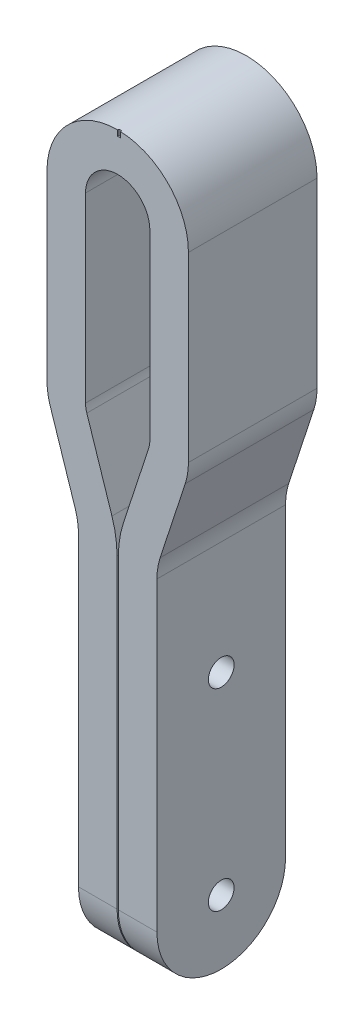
ISO-10303-21;
HEADER;
FILE_DESCRIPTION(('STEP AP214'),'2;1');
FILE_NAME('part.step','',(''),(''),'','','');
FILE_SCHEMA(('AUTOMOTIVE_DESIGN { 1 0 10303 214 1 1 1 1 }'));
ENDSEC;
DATA;
#1=APPLICATION_CONTEXT('core data for automotive mechanical design processes');
#2=APPLICATION_PROTOCOL_DEFINITION('international standard','automotive_design',2000,#1);
#3=PRODUCT_CONTEXT('',#1,'mechanical');
#4=PRODUCT('Part','Part','',(#3));
#5=PRODUCT_RELATED_PRODUCT_CATEGORY('part','',(#4));
#6=PRODUCT_DEFINITION_FORMATION('','',#4);
#7=PRODUCT_DEFINITION_CONTEXT('part definition',#1,'design');
#8=PRODUCT_DEFINITION('design','',#6,#7);
#9=PRODUCT_DEFINITION_SHAPE('','',#8);
#10=(LENGTH_UNIT() NAMED_UNIT(*) SI_UNIT(.MILLI.,.METRE.));
#11=(NAMED_UNIT(*) PLANE_ANGLE_UNIT() SI_UNIT($,.RADIAN.));
#12=(NAMED_UNIT(*) SI_UNIT($,.STERADIAN.) SOLID_ANGLE_UNIT());
#13=UNCERTAINTY_MEASURE_WITH_UNIT(LENGTH_MEASURE(1.E-05),#10,'distance_accuracy_value','');
#14=(GEOMETRIC_REPRESENTATION_CONTEXT(3) GLOBAL_UNCERTAINTY_ASSIGNED_CONTEXT((#13)) GLOBAL_UNIT_ASSIGNED_CONTEXT((#10,
#11,#12)) REPRESENTATION_CONTEXT('',''));
#15=CARTESIAN_POINT('',(0.,0.,0.));
#16=DIRECTION('',(0.,0.,1.));
#17=DIRECTION('',(1.,0.,0.));
#18=AXIS2_PLACEMENT_3D('',#15,#16,#17);
#19=CARTESIAN_POINT('',(0.0500000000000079,45.7325102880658,10.));
#20=DIRECTION('',(1.,0.,0.));
#21=DIRECTION('',(0.,1.,0.));
#22=AXIS2_PLACEMENT_3D('',#19,#20,#21);
#23=PLANE('',#22);
#24=CARTESIAN_POINT('',(0.0500000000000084,65.7325102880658,5.));
#25=DIRECTION('',(1.,0.,0.));
#26=DIRECTION('',(0.,1.,0.));
#27=AXIS2_PLACEMENT_3D('',#24,#25,#26);
#28=CIRCLE('',#27,1.);
#29=CARTESIAN_POINT('',(0.0500000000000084,66.7325102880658,5.));
#30=VERTEX_POINT('',#29);
#31=EDGE_CURVE('E271',#30,#30,#28,.T.);
#32=ORIENTED_EDGE('',*,*,#31,.T.);
#33=EDGE_LOOP('',(#32));
#34=FACE_BOUND('',#33,.T.);
#35=CARTESIAN_POINT('',(0.0500000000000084,50.7325102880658,5.));
#36=DIRECTION('',(1.,0.,0.));
#37=DIRECTION('',(0.,1.,0.));
#38=AXIS2_PLACEMENT_3D('',#35,#36,#37);
#39=CIRCLE('',#38,1.);
#40=CARTESIAN_POINT('',(0.0500000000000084,51.7325102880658,5.));
#41=VERTEX_POINT('',#40);
#42=EDGE_CURVE('E281',#41,#41,#39,.T.);
#43=ORIENTED_EDGE('',*,*,#42,.T.);
#44=EDGE_LOOP('',(#43));
#45=FACE_BOUND('',#44,.T.);
#46=CARTESIAN_POINT('',(0.050000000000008,50.7325102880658,5.));
#47=DIRECTION('',(1.,0.,0.));
#48=DIRECTION('',(0.,1.,0.));
#49=AXIS2_PLACEMENT_3D('',#46,#47,#48);
#50=CIRCLE('',#49,5.);
#51=CARTESIAN_POINT('',(0.050000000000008,50.7325102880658,0.));
#52=VERTEX_POINT('',#51);
#53=CARTESIAN_POINT('',(0.0500000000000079,45.7325102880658,5.));
#54=VERTEX_POINT('',#53);
#55=EDGE_CURVE('E450',#52,#54,#50,.F.);
#56=ORIENTED_EDGE('',*,*,#55,.T.);
#57=CARTESIAN_POINT('',(0.0500000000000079,50.7325102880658,5.));
#58=DIRECTION('',(1.,0.,0.));
#59=DIRECTION('',(0.,1.,0.));
#60=AXIS2_PLACEMENT_3D('',#57,#58,#59);
#61=CIRCLE('',#60,5.);
#62=CARTESIAN_POINT('',(0.050000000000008,50.7325102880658,10.));
#63=VERTEX_POINT('',#62);
#64=EDGE_CURVE('E452',#54,#63,#61,.F.);
#65=ORIENTED_EDGE('',*,*,#64,.T.);
#66=DIRECTION('',(0.,-1.,0.));
#67=VECTOR('',#66,1.);
#68=CARTESIAN_POINT('',(0.0500000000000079,45.7325102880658,10.));
#69=LINE('',#68,#67);
#70=CARTESIAN_POINT('',(0.0500000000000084,74.5128868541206,10.));
#71=VERTEX_POINT('',#70);
#72=EDGE_CURVE('E326',#71,#63,#69,.T.);
#73=ORIENTED_EDGE('',*,*,#72,.F.);
#74=DIRECTION('',(0.,0.,-1.));
#75=VECTOR('',#74,1.);
#76=CARTESIAN_POINT('',(0.0500000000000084,74.5128868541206,10.));
#77=LINE('',#76,#75);
#78=CARTESIAN_POINT('',(0.0500000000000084,74.5128868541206,0.));
#79=VERTEX_POINT('',#78);
#80=EDGE_CURVE('E430',#71,#79,#77,.T.);
#81=ORIENTED_EDGE('',*,*,#80,.T.);
#82=DIRECTION('',(0.,-1.,0.));
#83=VECTOR('',#82,1.);
#84=CARTESIAN_POINT('',(0.0500000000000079,45.7325102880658,0.));
#85=LINE('',#84,#83);
#86=EDGE_CURVE('E290',#79,#52,#85,.T.);
#87=ORIENTED_EDGE('',*,*,#86,.T.);
#88=EDGE_LOOP('',(#56,#65,#73,#81,#87));
#89=FACE_BOUND('',#88,.T.);
#90=ADVANCED_FACE('F31',(#34,#45,#89),#23,.F.);
#91=CARTESIAN_POINT('',(3.05000000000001,45.7325102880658,10.));
#92=DIRECTION('',(1.,0.,0.));
#93=DIRECTION('',(0.,1.,0.));
#94=AXIS2_PLACEMENT_3D('',#91,#92,#93);
#95=PLANE('',#94);
#96=CARTESIAN_POINT('',(3.05000000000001,65.7325102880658,5.));
#97=DIRECTION('',(1.,0.,0.));
#98=DIRECTION('',(0.,1.,0.));
#99=AXIS2_PLACEMENT_3D('',#96,#97,#98);
#100=CIRCLE('',#99,1.);
#101=CARTESIAN_POINT('',(3.05000000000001,66.7325102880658,5.));
#102=VERTEX_POINT('',#101);
#103=EDGE_CURVE('E264',#102,#102,#100,.T.);
#104=ORIENTED_EDGE('',*,*,#103,.F.);
#105=EDGE_LOOP('',(#104));
#106=FACE_BOUND('',#105,.T.);
#107=CARTESIAN_POINT('',(3.05000000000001,50.7325102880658,5.));
#108=DIRECTION('',(1.,0.,0.));
#109=DIRECTION('',(0.,1.,0.));
#110=AXIS2_PLACEMENT_3D('',#107,#108,#109);
#111=CIRCLE('',#110,1.);
#112=CARTESIAN_POINT('',(3.05000000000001,51.7325102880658,5.));
#113=VERTEX_POINT('',#112);
#114=EDGE_CURVE('E274',#113,#113,#111,.T.);
#115=ORIENTED_EDGE('',*,*,#114,.F.);
#116=EDGE_LOOP('',(#115));
#117=FACE_BOUND('',#116,.T.);
#118=DIRECTION('',(0.,-1.,0.));
#119=VECTOR('',#118,1.);
#120=CARTESIAN_POINT('',(3.05000000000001,45.7325102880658,10.));
#121=LINE('',#120,#119);
#122=CARTESIAN_POINT('',(3.05000000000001,74.5128868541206,10.));
#123=VERTEX_POINT('',#122);
#124=CARTESIAN_POINT('',(3.05000000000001,50.7325102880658,10.));
#125=VERTEX_POINT('',#124);
#126=EDGE_CURVE('E329',#123,#125,#121,.T.);
#127=ORIENTED_EDGE('',*,*,#126,.T.);
#128=CARTESIAN_POINT('',(3.05000000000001,50.7325102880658,5.));
#129=DIRECTION('',(1.,0.,0.));
#130=DIRECTION('',(0.,1.,0.));
#131=AXIS2_PLACEMENT_3D('',#128,#129,#130);
#132=CIRCLE('',#131,5.);
#133=CARTESIAN_POINT('',(3.05000000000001,45.7325102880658,5.));
#134=VERTEX_POINT('',#133);
#135=EDGE_CURVE('E462',#125,#134,#132,.T.);
#136=ORIENTED_EDGE('',*,*,#135,.T.);
#137=CARTESIAN_POINT('',(3.05000000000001,50.7325102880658,5.));
#138=DIRECTION('',(1.,0.,0.));
#139=DIRECTION('',(0.,1.,0.));
#140=AXIS2_PLACEMENT_3D('',#137,#138,#139);
#141=CIRCLE('',#140,5.);
#142=CARTESIAN_POINT('',(3.05000000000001,50.7325102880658,0.));
#143=VERTEX_POINT('',#142);
#144=EDGE_CURVE('E460',#134,#143,#141,.T.);
#145=ORIENTED_EDGE('',*,*,#144,.T.);
#146=DIRECTION('',(0.,-1.,0.));
#147=VECTOR('',#146,1.);
#148=CARTESIAN_POINT('',(3.05000000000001,45.7325102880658,0.));
#149=LINE('',#148,#147);
#150=CARTESIAN_POINT('',(3.05000000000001,74.5128868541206,0.));
#151=VERTEX_POINT('',#150);
#152=EDGE_CURVE('E293',#151,#143,#149,.T.);
#153=ORIENTED_EDGE('',*,*,#152,.F.);
#154=DIRECTION('',(0.,0.,-1.));
#155=VECTOR('',#154,1.);
#156=CARTESIAN_POINT('',(3.05000000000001,74.5128868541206,10.));
#157=LINE('',#156,#155);
#158=EDGE_CURVE('E396',#151,#123,#157,.F.);
#159=ORIENTED_EDGE('',*,*,#158,.T.);
#160=EDGE_LOOP('',(#127,#136,#145,#153,#159));
#161=FACE_BOUND('',#160,.T.);
#162=ADVANCED_FACE('F498',(#106,#117,#161),#95,.T.);
#163=CARTESIAN_POINT('',(3.05000000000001,75.3115226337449,10.));
#164=DIRECTION('',(0.950243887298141,-0.311506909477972,0.));
#165=DIRECTION('',(0.311506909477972,0.950243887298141,0.));
#166=AXIS2_PLACEMENT_3D('',#163,#164,#165);
#167=PLANE('',#166);
#168=DIRECTION('',(-0.311506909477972,-0.950243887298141,0.));
#169=VECTOR('',#168,1.);
#170=CARTESIAN_POINT('',(3.05000000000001,75.3115226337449,10.));
#171=LINE('',#170,#169);
#172=CARTESIAN_POINT('',(5.2512194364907,82.0262864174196,10.));
#173=VERTEX_POINT('',#172);
#174=CARTESIAN_POINT('',(3.2987805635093,76.0704214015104,10.));
#175=VERTEX_POINT('',#174);
#176=EDGE_CURVE('E332',#173,#175,#171,.T.);
#177=ORIENTED_EDGE('',*,*,#176,.T.);
#178=DIRECTION('',(0.,0.,-1.));
#179=VECTOR('',#178,1.);
#180=CARTESIAN_POINT('',(3.2987805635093,76.0704214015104,0.));
#181=LINE('',#180,#179);
#182=CARTESIAN_POINT('',(3.2987805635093,76.0704214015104,0.));
#183=VERTEX_POINT('',#182);
#184=EDGE_CURVE('E393',#175,#183,#181,.T.);
#185=ORIENTED_EDGE('',*,*,#184,.T.);
#186=DIRECTION('',(-0.311506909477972,-0.950243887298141,0.));
#187=VECTOR('',#186,1.);
#188=CARTESIAN_POINT('',(3.05000000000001,75.3115226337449,0.));
#189=LINE('',#188,#187);
#190=CARTESIAN_POINT('',(5.2512194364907,82.0262864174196,0.));
#191=VERTEX_POINT('',#190);
#192=EDGE_CURVE('E296',#191,#183,#189,.T.);
#193=ORIENTED_EDGE('',*,*,#192,.F.);
#194=DIRECTION('',(0.,0.,-1.));
#195=VECTOR('',#194,1.);
#196=CARTESIAN_POINT('',(5.2512194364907,82.0262864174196,10.));
#197=LINE('',#196,#195);
#198=EDGE_CURVE('E391',#191,#173,#197,.F.);
#199=ORIENTED_EDGE('',*,*,#198,.T.);
#200=EDGE_LOOP('',(#177,#185,#193,#199));
#201=FACE_BOUND('',#200,.T.);
#202=ADVANCED_FACE('F504',(#201),#167,.T.);
#203=CARTESIAN_POINT('',(5.49999999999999,82.7851851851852,10.));
#204=DIRECTION('',(1.,0.,0.));
#205=DIRECTION('',(0.,1.,0.));
#206=AXIS2_PLACEMENT_3D('',#203,#204,#205);
#207=PLANE('',#206);
#208=DIRECTION('',(0.,-1.,0.));
#209=VECTOR('',#208,1.);
#210=CARTESIAN_POINT('',(5.49999999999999,82.7851851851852,10.));
#211=LINE('',#210,#209);
#212=CARTESIAN_POINT('',(5.50000000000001,97.7325102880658,10.));
#213=VERTEX_POINT('',#212);
#214=CARTESIAN_POINT('',(5.5,83.5838209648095,10.));
#215=VERTEX_POINT('',#214);
#216=EDGE_CURVE('E335',#213,#215,#211,.T.);
#217=ORIENTED_EDGE('',*,*,#216,.T.);
#218=DIRECTION('',(0.,0.,-1.));
#219=VECTOR('',#218,1.);
#220=CARTESIAN_POINT('',(5.5,83.5838209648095,10.));
#221=LINE('',#220,#219);
#222=CARTESIAN_POINT('',(5.5,83.5838209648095,0.));
#223=VERTEX_POINT('',#222);
#224=EDGE_CURVE('E398',#215,#223,#221,.T.);
#225=ORIENTED_EDGE('',*,*,#224,.T.);
#226=DIRECTION('',(0.,-1.,0.));
#227=VECTOR('',#226,1.);
#228=CARTESIAN_POINT('',(5.49999999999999,82.7851851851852,0.));
#229=LINE('',#228,#227);
#230=CARTESIAN_POINT('',(5.50000000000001,97.7325102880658,0.));
#231=VERTEX_POINT('',#230);
#232=EDGE_CURVE('E299',#231,#223,#229,.T.);
#233=ORIENTED_EDGE('',*,*,#232,.F.);
#234=DIRECTION('',(0.,0.,-1.));
#235=VECTOR('',#234,1.);
#236=CARTESIAN_POINT('',(5.50000000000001,97.7325102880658,10.));
#237=LINE('',#236,#235);
#238=EDGE_CURVE('E371',#213,#231,#237,.T.);
#239=ORIENTED_EDGE('',*,*,#238,.F.);
#240=EDGE_LOOP('',(#217,#225,#233,#239));
#241=FACE_BOUND('',#240,.T.);
#242=ADVANCED_FACE('F540',(#241),#207,.T.);
#243=CARTESIAN_POINT('',(0.,97.7325102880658,10.));
#244=DIRECTION('',(0.,0.,-1.));
#245=DIRECTION('',(-1.,0.,0.));
#246=AXIS2_PLACEMENT_3D('',#243,#244,#245);
#247=CYLINDRICAL_SURFACE('',#246,5.5);
#248=DIRECTION('',(0.,0.,1.));
#249=VECTOR('',#248,1.);
#250=CARTESIAN_POINT('',(0.,103.232510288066,9.9));
#251=LINE('',#250,#249);
#252=CARTESIAN_POINT('',(0.,103.232510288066,9.9));
#253=VERTEX_POINT('',#252);
#254=CARTESIAN_POINT('',(0.,103.232510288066,10.));
#255=VERTEX_POINT('',#254);
#256=EDGE_CURVE('E239',#253,#255,#251,.T.);
#257=ORIENTED_EDGE('',*,*,#256,.F.);
#258=CARTESIAN_POINT('',(0.,97.7325102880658,9.9));
#259=DIRECTION('',(0.,0.,1.));
#260=DIRECTION('',(1.,0.,0.));
#261=AXIS2_PLACEMENT_3D('',#258,#259,#260);
#262=CIRCLE('',#261,5.5);
#263=CARTESIAN_POINT('',(0.211811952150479,103.228430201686,9.9));
#264=VERTEX_POINT('',#263);
#265=EDGE_CURVE('E11',#253,#264,#262,.F.);
#266=ORIENTED_EDGE('',*,*,#265,.T.);
#267=DIRECTION('',(0.,0.,-1.));
#268=VECTOR('',#267,1.);
#269=CARTESIAN_POINT('',(0.211811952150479,103.228430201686,10.));
#270=LINE('',#269,#268);
#271=CARTESIAN_POINT('',(0.211811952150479,103.228430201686,10.));
#272=VERTEX_POINT('',#271);
#273=EDGE_CURVE('E260',#272,#264,#270,.T.);
#274=ORIENTED_EDGE('',*,*,#273,.F.);
#275=CARTESIAN_POINT('',(0.,97.7325102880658,10.));
#276=DIRECTION('',(0.,0.,-1.));
#277=DIRECTION('',(1.,0.,0.));
#278=AXIS2_PLACEMENT_3D('',#275,#276,#277);
#279=CIRCLE('',#278,5.5);
#280=EDGE_CURVE('E250',#272,#213,#279,.T.);
#281=ORIENTED_EDGE('',*,*,#280,.T.);
#282=ORIENTED_EDGE('',*,*,#238,.T.);
#283=CARTESIAN_POINT('',(0.,97.7325102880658,0.));
#284=DIRECTION('',(0.,0.,-1.));
#285=DIRECTION('',(1.,0.,0.));
#286=AXIS2_PLACEMENT_3D('',#283,#284,#285);
#287=CIRCLE('',#286,5.5);
#288=CARTESIAN_POINT('',(-5.5,97.7325102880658,0.));
#289=VERTEX_POINT('',#288);
#290=EDGE_CURVE('E302',#289,#231,#287,.T.);
#291=ORIENTED_EDGE('',*,*,#290,.F.);
#292=DIRECTION('',(0.,0.,-1.));
#293=VECTOR('',#292,1.);
#294=CARTESIAN_POINT('',(-5.5,97.7325102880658,10.));
#295=LINE('',#294,#293);
#296=CARTESIAN_POINT('',(-5.5,97.7325102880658,10.));
#297=VERTEX_POINT('',#296);
#298=EDGE_CURVE('E368',#297,#289,#295,.T.);
#299=ORIENTED_EDGE('',*,*,#298,.F.);
#300=EDGE_CURVE('E338',#297,#255,#279,.T.);
#301=ORIENTED_EDGE('',*,*,#300,.T.);
#302=EDGE_LOOP('',(#257,#266,#274,#281,#282,#291,#299,#301));
#303=FACE_BOUND('',#302,.T.);
#304=ADVANCED_FACE('F545',(#303),#247,.T.);
#305=CARTESIAN_POINT('',(-5.49999999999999,82.7851851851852,10.));
#306=DIRECTION('',(-1.,0.,0.));
#307=DIRECTION('',(0.,-1.,0.));
#308=AXIS2_PLACEMENT_3D('',#305,#306,#307);
#309=PLANE('',#308);
#310=DIRECTION('',(0.,1.,0.));
#311=VECTOR('',#310,1.);
#312=CARTESIAN_POINT('',(-5.49999999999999,82.7851851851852,0.));
#313=LINE('',#312,#311);
#314=CARTESIAN_POINT('',(-5.49999999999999,83.5838209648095,0.));
#315=VERTEX_POINT('',#314);
#316=EDGE_CURVE('E305',#315,#289,#313,.T.);
#317=ORIENTED_EDGE('',*,*,#316,.F.);
#318=DIRECTION('',(0.,0.,-1.));
#319=VECTOR('',#318,1.);
#320=CARTESIAN_POINT('',(-5.49999999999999,83.5838209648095,10.));
#321=LINE('',#320,#319);
#322=CARTESIAN_POINT('',(-5.49999999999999,83.5838209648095,10.));
#323=VERTEX_POINT('',#322);
#324=EDGE_CURVE('E385',#315,#323,#321,.F.);
#325=ORIENTED_EDGE('',*,*,#324,.T.);
#326=DIRECTION('',(0.,1.,0.));
#327=VECTOR('',#326,1.);
#328=CARTESIAN_POINT('',(-5.49999999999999,82.7851851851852,10.));
#329=LINE('',#328,#327);
#330=EDGE_CURVE('E341',#323,#297,#329,.T.);
#331=ORIENTED_EDGE('',*,*,#330,.T.);
#332=ORIENTED_EDGE('',*,*,#298,.T.);
#333=EDGE_LOOP('',(#317,#325,#331,#332));
#334=FACE_BOUND('',#333,.T.);
#335=ADVANCED_FACE('F668',(#334),#309,.T.);
#336=CARTESIAN_POINT('',(-3.05,75.3115226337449,10.));
#337=DIRECTION('',(-0.950243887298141,-0.311506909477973,0.));
#338=DIRECTION('',(0.311506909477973,-0.950243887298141,0.));
#339=AXIS2_PLACEMENT_3D('',#336,#337,#338);
#340=PLANE('',#339);
#341=DIRECTION('',(-0.311506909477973,0.950243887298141,0.));
#342=VECTOR('',#341,1.);
#343=CARTESIAN_POINT('',(-3.05,75.3115226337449,0.));
#344=LINE('',#343,#342);
#345=CARTESIAN_POINT('',(-3.29878056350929,76.0704214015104,0.));
#346=VERTEX_POINT('',#345);
#347=CARTESIAN_POINT('',(-5.2512194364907,82.0262864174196,0.));
#348=VERTEX_POINT('',#347);
#349=EDGE_CURVE('E307',#346,#348,#344,.T.);
#350=ORIENTED_EDGE('',*,*,#349,.F.);
#351=DIRECTION('',(0.,0.,-1.));
#352=VECTOR('',#351,1.);
#353=CARTESIAN_POINT('',(-3.29878056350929,76.0704214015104,10.));
#354=LINE('',#353,#352);
#355=CARTESIAN_POINT('',(-3.29878056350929,76.0704214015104,10.));
#356=VERTEX_POINT('',#355);
#357=EDGE_CURVE('E379',#346,#356,#354,.F.);
#358=ORIENTED_EDGE('',*,*,#357,.T.);
#359=DIRECTION('',(-0.311506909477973,0.950243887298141,0.));
#360=VECTOR('',#359,1.);
#361=CARTESIAN_POINT('',(-3.05,75.3115226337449,10.));
#362=LINE('',#361,#360);
#363=CARTESIAN_POINT('',(-5.2512194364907,82.0262864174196,10.));
#364=VERTEX_POINT('',#363);
#365=EDGE_CURVE('E343',#356,#364,#362,.T.);
#366=ORIENTED_EDGE('',*,*,#365,.T.);
#367=DIRECTION('',(0.,0.,-1.));
#368=VECTOR('',#367,1.);
#369=CARTESIAN_POINT('',(-5.2512194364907,82.0262864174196,10.));
#370=LINE('',#369,#368);
#371=EDGE_CURVE('E376',#364,#348,#370,.T.);
#372=ORIENTED_EDGE('',*,*,#371,.T.);
#373=EDGE_LOOP('',(#350,#358,#366,#372));
#374=FACE_BOUND('',#373,.T.);
#375=ADVANCED_FACE('F561',(#374),#340,.T.);
#376=CARTESIAN_POINT('',(-3.04999999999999,45.7325102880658,10.));
#377=DIRECTION('',(-1.,0.,0.));
#378=DIRECTION('',(0.,-1.,0.));
#379=AXIS2_PLACEMENT_3D('',#376,#377,#378);
#380=PLANE('',#379);
#381=CARTESIAN_POINT('',(-3.05,65.7325102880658,5.));
#382=DIRECTION('',(-1.,0.,0.));
#383=DIRECTION('',(0.,-1.,0.));
#384=AXIS2_PLACEMENT_3D('',#381,#382,#383);
#385=CIRCLE('',#384,1.);
#386=CARTESIAN_POINT('',(-3.05,64.7325102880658,5.));
#387=VERTEX_POINT('',#386);
#388=EDGE_CURVE('E268',#387,#387,#385,.T.);
#389=ORIENTED_EDGE('',*,*,#388,.F.);
#390=EDGE_LOOP('',(#389));
#391=FACE_BOUND('',#390,.T.);
#392=CARTESIAN_POINT('',(-3.04999999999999,50.7325102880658,5.));
#393=DIRECTION('',(-1.,0.,0.));
#394=DIRECTION('',(0.,-1.,0.));
#395=AXIS2_PLACEMENT_3D('',#392,#393,#394);
#396=CIRCLE('',#395,1.);
#397=CARTESIAN_POINT('',(-3.04999999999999,49.7325102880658,5.));
#398=VERTEX_POINT('',#397);
#399=EDGE_CURVE('E278',#398,#398,#396,.T.);
#400=ORIENTED_EDGE('',*,*,#399,.F.);
#401=EDGE_LOOP('',(#400));
#402=FACE_BOUND('',#401,.T.);
#403=CARTESIAN_POINT('',(-3.04999999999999,50.7325102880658,5.));
#404=DIRECTION('',(-1.,0.,0.));
#405=DIRECTION('',(0.,-1.,0.));
#406=AXIS2_PLACEMENT_3D('',#403,#404,#405);
#407=CIRCLE('',#406,5.);
#408=CARTESIAN_POINT('',(-3.04999999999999,50.7325102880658,0.));
#409=VERTEX_POINT('',#408);
#410=CARTESIAN_POINT('',(-3.04999999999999,45.7325102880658,5.));
#411=VERTEX_POINT('',#410);
#412=EDGE_CURVE('E464',#409,#411,#407,.T.);
#413=ORIENTED_EDGE('',*,*,#412,.T.);
#414=CARTESIAN_POINT('',(-3.04999999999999,50.7325102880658,5.));
#415=DIRECTION('',(-1.,0.,0.));
#416=DIRECTION('',(0.,-1.,0.));
#417=AXIS2_PLACEMENT_3D('',#414,#415,#416);
#418=CIRCLE('',#417,5.);
#419=CARTESIAN_POINT('',(-3.04999999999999,50.7325102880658,10.));
#420=VERTEX_POINT('',#419);
#421=EDGE_CURVE('E466',#411,#420,#418,.T.);
#422=ORIENTED_EDGE('',*,*,#421,.T.);
#423=DIRECTION('',(0.,1.,0.));
#424=VECTOR('',#423,1.);
#425=CARTESIAN_POINT('',(-3.04999999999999,45.7325102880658,10.));
#426=LINE('',#425,#424);
#427=CARTESIAN_POINT('',(-3.05,74.5128868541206,10.));
#428=VERTEX_POINT('',#427);
#429=EDGE_CURVE('E346',#420,#428,#426,.T.);
#430=ORIENTED_EDGE('',*,*,#429,.T.);
#431=DIRECTION('',(0.,0.,-1.));
#432=VECTOR('',#431,1.);
#433=CARTESIAN_POINT('',(-3.05,74.5128868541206,0.));
#434=LINE('',#433,#432);
#435=CARTESIAN_POINT('',(-3.05,74.5128868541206,0.));
#436=VERTEX_POINT('',#435);
#437=EDGE_CURVE('E373',#428,#436,#434,.T.);
#438=ORIENTED_EDGE('',*,*,#437,.T.);
#439=DIRECTION('',(0.,1.,0.));
#440=VECTOR('',#439,1.);
#441=CARTESIAN_POINT('',(-3.04999999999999,45.7325102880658,0.));
#442=LINE('',#441,#440);
#443=EDGE_CURVE('E310',#409,#436,#442,.T.);
#444=ORIENTED_EDGE('',*,*,#443,.F.);
#445=EDGE_LOOP('',(#413,#422,#430,#438,#444));
#446=FACE_BOUND('',#445,.T.);
#447=ADVANCED_FACE('F574',(#391,#402,#446),#380,.T.);
#448=CARTESIAN_POINT('',(-0.0499999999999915,45.7325102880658,10.));
#449=DIRECTION('',(-1.,0.,0.));
#450=DIRECTION('',(0.,-1.,0.));
#451=AXIS2_PLACEMENT_3D('',#448,#449,#450);
#452=PLANE('',#451);
#453=CARTESIAN_POINT('',(-0.0499999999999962,65.7325102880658,5.));
#454=DIRECTION('',(-1.,0.,0.));
#455=DIRECTION('',(0.,-1.,0.));
#456=AXIS2_PLACEMENT_3D('',#453,#454,#455);
#457=CIRCLE('',#456,1.);
#458=CARTESIAN_POINT('',(-0.049999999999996,64.7325102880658,5.));
#459=VERTEX_POINT('',#458);
#460=EDGE_CURVE('E267',#459,#459,#457,.T.);
#461=ORIENTED_EDGE('',*,*,#460,.T.);
#462=EDGE_LOOP('',(#461));
#463=FACE_BOUND('',#462,.T.);
#464=CARTESIAN_POINT('',(-0.0499999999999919,50.7325102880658,5.));
#465=DIRECTION('',(-1.,0.,0.));
#466=DIRECTION('',(0.,-1.,0.));
#467=AXIS2_PLACEMENT_3D('',#464,#465,#466);
#468=CIRCLE('',#467,1.);
#469=CARTESIAN_POINT('',(-0.0499999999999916,49.7325102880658,5.));
#470=VERTEX_POINT('',#469);
#471=EDGE_CURVE('E277',#470,#470,#468,.T.);
#472=ORIENTED_EDGE('',*,*,#471,.T.);
#473=EDGE_LOOP('',(#472));
#474=FACE_BOUND('',#473,.T.);
#475=DIRECTION('',(0.,1.,0.));
#476=VECTOR('',#475,1.);
#477=CARTESIAN_POINT('',(-0.0499999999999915,45.7325102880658,10.));
#478=LINE('',#477,#476);
#479=CARTESIAN_POINT('',(-0.0499999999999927,50.7325102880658,10.));
#480=VERTEX_POINT('',#479);
#481=CARTESIAN_POINT('',(-0.0499999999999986,74.5128868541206,10.));
#482=VERTEX_POINT('',#481);
#483=EDGE_CURVE('E348',#480,#482,#478,.T.);
#484=ORIENTED_EDGE('',*,*,#483,.F.);
#485=CARTESIAN_POINT('',(-0.0499999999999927,50.7325102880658,5.));
#486=DIRECTION('',(-1.,0.,0.));
#487=DIRECTION('',(0.,-1.,0.));
#488=AXIS2_PLACEMENT_3D('',#485,#486,#487);
#489=CIRCLE('',#488,5.);
#490=CARTESIAN_POINT('',(-0.0499999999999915,45.7325102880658,5.));
#491=VERTEX_POINT('',#490);
#492=EDGE_CURVE('E53',#480,#491,#489,.F.);
#493=ORIENTED_EDGE('',*,*,#492,.T.);
#494=CARTESIAN_POINT('',(-0.0499999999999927,50.7325102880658,5.));
#495=DIRECTION('',(-1.,0.,0.));
#496=DIRECTION('',(0.,-1.,0.));
#497=AXIS2_PLACEMENT_3D('',#494,#495,#496);
#498=CIRCLE('',#497,5.);
#499=CARTESIAN_POINT('',(-0.0499999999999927,50.7325102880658,0.));
#500=VERTEX_POINT('',#499);
#501=EDGE_CURVE('E468',#491,#500,#498,.F.);
#502=ORIENTED_EDGE('',*,*,#501,.T.);
#503=DIRECTION('',(0.,1.,0.));
#504=VECTOR('',#503,1.);
#505=CARTESIAN_POINT('',(-0.0499999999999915,45.7325102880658,0.));
#506=LINE('',#505,#504);
#507=CARTESIAN_POINT('',(-0.0499999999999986,74.5128868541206,0.));
#508=VERTEX_POINT('',#507);
#509=EDGE_CURVE('E312',#500,#508,#506,.T.);
#510=ORIENTED_EDGE('',*,*,#509,.T.);
#511=DIRECTION('',(0.,0.,-1.));
#512=VECTOR('',#511,1.);
#513=CARTESIAN_POINT('',(-0.0499999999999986,74.5128868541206,10.));
#514=LINE('',#513,#512);
#515=EDGE_CURVE('E447',#508,#482,#514,.F.);
#516=ORIENTED_EDGE('',*,*,#515,.T.);
#517=EDGE_LOOP('',(#484,#493,#502,#510,#516));
#518=FACE_BOUND('',#517,.T.);
#519=ADVANCED_FACE('F478',(#463,#474,#518),#452,.F.);
#520=CARTESIAN_POINT('',(-0.199268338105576,76.2460433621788,10.));
#521=DIRECTION('',(-0.950243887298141,-0.311506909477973,0.));
#522=DIRECTION('',(0.311506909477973,-0.950243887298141,0.));
#523=AXIS2_PLACEMENT_3D('',#520,#521,#522);
#524=PLANE('',#523);
#525=DIRECTION('',(-0.311506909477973,0.950243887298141,0.));
#526=VECTOR('',#525,1.);
#527=CARTESIAN_POINT('',(-0.199268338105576,76.2460433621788,10.));
#528=LINE('',#527,#526);
#529=CARTESIAN_POINT('',(-0.448048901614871,77.0049421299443,10.));
#530=VERTEX_POINT('',#529);
#531=CARTESIAN_POINT('',(-2.40048777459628,82.9608071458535,10.));
#532=VERTEX_POINT('',#531);
#533=EDGE_CURVE('E350',#530,#532,#528,.T.);
#534=ORIENTED_EDGE('',*,*,#533,.F.);
#535=DIRECTION('',(0.,0.,-1.));
#536=VECTOR('',#535,1.);
#537=CARTESIAN_POINT('',(-0.448048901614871,77.0049421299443,10.));
#538=LINE('',#537,#536);
#539=CARTESIAN_POINT('',(-0.448048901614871,77.0049421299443,0.));
#540=VERTEX_POINT('',#539);
#541=EDGE_CURVE('E444',#530,#540,#538,.T.);
#542=ORIENTED_EDGE('',*,*,#541,.T.);
#543=DIRECTION('',(-0.311506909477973,0.950243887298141,0.));
#544=VECTOR('',#543,1.);
#545=CARTESIAN_POINT('',(-0.199268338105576,76.2460433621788,0.));
#546=LINE('',#545,#544);
#547=CARTESIAN_POINT('',(-2.40048777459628,82.9608071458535,0.));
#548=VERTEX_POINT('',#547);
#549=EDGE_CURVE('E314',#540,#548,#546,.T.);
#550=ORIENTED_EDGE('',*,*,#549,.T.);
#551=DIRECTION('',(0.,0.,-1.));
#552=VECTOR('',#551,1.);
#553=CARTESIAN_POINT('',(-2.40048777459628,82.9608071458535,10.));
#554=LINE('',#553,#552);
#555=EDGE_CURVE('E413',#548,#532,#554,.F.);
#556=ORIENTED_EDGE('',*,*,#555,.T.);
#557=EDGE_LOOP('',(#534,#542,#550,#556));
#558=FACE_BOUND('',#557,.T.);
#559=ADVANCED_FACE('F593',(#558),#524,.F.);
#560=CARTESIAN_POINT('',(-2.49999999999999,82.7851851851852,10.));
#561=DIRECTION('',(-1.,0.,0.));
#562=DIRECTION('',(0.,-1.,0.));
#563=AXIS2_PLACEMENT_3D('',#560,#561,#562);
#564=PLANE('',#563);
#565=DIRECTION('',(0.,1.,0.));
#566=VECTOR('',#565,1.);
#567=CARTESIAN_POINT('',(-2.49999999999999,82.7851851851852,10.));
#568=LINE('',#567,#566);
#569=CARTESIAN_POINT('',(-2.49999999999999,83.5838209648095,10.));
#570=VERTEX_POINT('',#569);
#571=CARTESIAN_POINT('',(-2.5,97.7325102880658,10.));
#572=VERTEX_POINT('',#571);
#573=EDGE_CURVE('E352',#570,#572,#568,.T.);
#574=ORIENTED_EDGE('',*,*,#573,.F.);
#575=DIRECTION('',(0.,0.,-1.));
#576=VECTOR('',#575,1.);
#577=CARTESIAN_POINT('',(-2.49999999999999,83.5838209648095,0.));
#578=LINE('',#577,#576);
#579=CARTESIAN_POINT('',(-2.49999999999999,83.5838209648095,0.));
#580=VERTEX_POINT('',#579);
#581=EDGE_CURVE('E410',#570,#580,#578,.T.);
#582=ORIENTED_EDGE('',*,*,#581,.T.);
#583=DIRECTION('',(0.,1.,0.));
#584=VECTOR('',#583,1.);
#585=CARTESIAN_POINT('',(-2.49999999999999,82.7851851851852,0.));
#586=LINE('',#585,#584);
#587=CARTESIAN_POINT('',(-2.5,97.7325102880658,0.));
#588=VERTEX_POINT('',#587);
#589=EDGE_CURVE('E316',#580,#588,#586,.T.);
#590=ORIENTED_EDGE('',*,*,#589,.T.);
#591=DIRECTION('',(0.,0.,-1.));
#592=VECTOR('',#591,1.);
#593=CARTESIAN_POINT('',(-2.5,97.7325102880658,10.));
#594=LINE('',#593,#592);
#595=EDGE_CURVE('E365',#572,#588,#594,.T.);
#596=ORIENTED_EDGE('',*,*,#595,.F.);
#597=EDGE_LOOP('',(#574,#582,#590,#596));
#598=FACE_BOUND('',#597,.T.);
#599=ADVANCED_FACE('F602',(#598),#564,.F.);
#600=CARTESIAN_POINT('',(0.,97.7325102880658,10.));
#601=DIRECTION('',(0.,0.,-1.));
#602=DIRECTION('',(-1.,0.,0.));
#603=AXIS2_PLACEMENT_3D('',#600,#601,#602);
#604=CYLINDRICAL_SURFACE('',#603,2.5);
#605=CARTESIAN_POINT('',(0.,97.7325102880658,0.));
#606=DIRECTION('',(0.,0.,1.));
#607=DIRECTION('',(1.,0.,0.));
#608=AXIS2_PLACEMENT_3D('',#605,#606,#607);
#609=CIRCLE('',#608,2.5);
#610=CARTESIAN_POINT('',(2.5,97.7325102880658,0.));
#611=VERTEX_POINT('',#610);
#612=EDGE_CURVE('E318',#588,#611,#609,.F.);
#613=ORIENTED_EDGE('',*,*,#612,.T.);
#614=DIRECTION('',(0.,0.,-1.));
#615=VECTOR('',#614,1.);
#616=CARTESIAN_POINT('',(2.5,97.7325102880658,10.));
#617=LINE('',#616,#615);
#618=CARTESIAN_POINT('',(2.5,97.7325102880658,10.));
#619=VERTEX_POINT('',#618);
#620=EDGE_CURVE('E362',#619,#611,#617,.T.);
#621=ORIENTED_EDGE('',*,*,#620,.F.);
#622=CARTESIAN_POINT('',(0.,97.7325102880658,10.));
#623=DIRECTION('',(0.,0.,1.));
#624=DIRECTION('',(1.,0.,0.));
#625=AXIS2_PLACEMENT_3D('',#622,#623,#624);
#626=CIRCLE('',#625,2.5);
#627=EDGE_CURVE('E354',#572,#619,#626,.F.);
#628=ORIENTED_EDGE('',*,*,#627,.F.);
#629=ORIENTED_EDGE('',*,*,#595,.T.);
#630=EDGE_LOOP('',(#613,#621,#628,#629));
#631=FACE_BOUND('',#630,.T.);
#632=ADVANCED_FACE('F608',(#631),#604,.F.);
#633=CARTESIAN_POINT('',(2.49999999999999,82.7851851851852,10.));
#634=DIRECTION('',(1.,0.,0.));
#635=DIRECTION('',(0.,1.,0.));
#636=AXIS2_PLACEMENT_3D('',#633,#634,#635);
#637=PLANE('',#636);
#638=DIRECTION('',(0.,-1.,0.));
#639=VECTOR('',#638,1.);
#640=CARTESIAN_POINT('',(2.49999999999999,82.7851851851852,0.));
#641=LINE('',#640,#639);
#642=CARTESIAN_POINT('',(2.49999999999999,83.5838209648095,0.));
#643=VERTEX_POINT('',#642);
#644=EDGE_CURVE('E320',#611,#643,#641,.T.);
#645=ORIENTED_EDGE('',*,*,#644,.T.);
#646=DIRECTION('',(0.,0.,-1.));
#647=VECTOR('',#646,1.);
#648=CARTESIAN_POINT('',(2.49999999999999,83.5838209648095,10.));
#649=LINE('',#648,#647);
#650=CARTESIAN_POINT('',(2.49999999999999,83.5838209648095,10.));
#651=VERTEX_POINT('',#650);
#652=EDGE_CURVE('E419',#643,#651,#649,.F.);
#653=ORIENTED_EDGE('',*,*,#652,.T.);
#654=DIRECTION('',(0.,-1.,0.));
#655=VECTOR('',#654,1.);
#656=CARTESIAN_POINT('',(2.49999999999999,82.7851851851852,10.));
#657=LINE('',#656,#655);
#658=EDGE_CURVE('E356',#619,#651,#657,.T.);
#659=ORIENTED_EDGE('',*,*,#658,.F.);
#660=ORIENTED_EDGE('',*,*,#620,.T.);
#661=EDGE_LOOP('',(#645,#653,#659,#660));
#662=FACE_BOUND('',#661,.T.);
#663=ADVANCED_FACE('F652',(#662),#637,.F.);
#664=CARTESIAN_POINT('',(0.199268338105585,76.2460433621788,10.));
#665=DIRECTION('',(0.950243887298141,-0.311506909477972,0.));
#666=DIRECTION('',(0.311506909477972,0.950243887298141,0.));
#667=AXIS2_PLACEMENT_3D('',#664,#665,#666);
#668=PLANE('',#667);
#669=DIRECTION('',(-0.311506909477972,-0.950243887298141,0.));
#670=VECTOR('',#669,1.);
#671=CARTESIAN_POINT('',(0.199268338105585,76.2460433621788,0.));
#672=LINE('',#671,#670);
#673=CARTESIAN_POINT('',(2.40048777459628,82.9608071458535,0.));
#674=VERTEX_POINT('',#673);
#675=CARTESIAN_POINT('',(0.448048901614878,77.0049421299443,0.));
#676=VERTEX_POINT('',#675);
#677=EDGE_CURVE('E323',#674,#676,#672,.T.);
#678=ORIENTED_EDGE('',*,*,#677,.T.);
#679=DIRECTION('',(0.,0.,-1.));
#680=VECTOR('',#679,1.);
#681=CARTESIAN_POINT('',(0.448048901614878,77.0049421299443,10.));
#682=LINE('',#681,#680);
#683=CARTESIAN_POINT('',(0.448048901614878,77.0049421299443,10.));
#684=VERTEX_POINT('',#683);
#685=EDGE_CURVE('E438',#676,#684,#682,.F.);
#686=ORIENTED_EDGE('',*,*,#685,.T.);
#687=DIRECTION('',(-0.311506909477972,-0.950243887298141,0.));
#688=VECTOR('',#687,1.);
#689=CARTESIAN_POINT('',(0.199268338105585,76.2460433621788,10.));
#690=LINE('',#689,#688);
#691=CARTESIAN_POINT('',(2.40048777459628,82.9608071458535,10.));
#692=VERTEX_POINT('',#691);
#693=EDGE_CURVE('E359',#692,#684,#690,.T.);
#694=ORIENTED_EDGE('',*,*,#693,.F.);
#695=DIRECTION('',(0.,0.,-1.));
#696=VECTOR('',#695,1.);
#697=CARTESIAN_POINT('',(2.40048777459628,82.9608071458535,0.));
#698=LINE('',#697,#696);
#699=EDGE_CURVE('E416',#692,#674,#698,.T.);
#700=ORIENTED_EDGE('',*,*,#699,.T.);
#701=EDGE_LOOP('',(#678,#686,#694,#700));
#702=FACE_BOUND('',#701,.T.);
#703=ADVANCED_FACE('F619',(#702),#668,.F.);
#704=CARTESIAN_POINT('',(0.,97.7325102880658,10.));
#705=DIRECTION('',(0.,0.,-1.));
#706=DIRECTION('',(-1.,0.,0.));
#707=AXIS2_PLACEMENT_3D('',#704,#705,#706);
#708=PLANE('',#707);
#709=DIRECTION('',(1.,0.,0.));
#710=VECTOR('',#709,1.);
#711=CARTESIAN_POINT('',(0.,102.799107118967,10.));
#712=LINE('',#711,#710);
#713=CARTESIAN_POINT('',(0.,102.799107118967,10.));
#714=VERTEX_POINT('',#713);
#715=CARTESIAN_POINT('',(0.211811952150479,102.799107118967,10.));
#716=VERTEX_POINT('',#715);
#717=EDGE_CURVE('E243',#714,#716,#712,.T.);
#718=ORIENTED_EDGE('',*,*,#717,.F.);
#719=DIRECTION('',(0.,-1.,0.));
#720=VECTOR('',#719,1.);
#721=CARTESIAN_POINT('',(0.,103.232510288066,10.));
#722=LINE('',#721,#720);
#723=EDGE_CURVE('E45',#255,#714,#722,.T.);
#724=ORIENTED_EDGE('',*,*,#723,.F.);
#725=ORIENTED_EDGE('',*,*,#300,.F.);
#726=ORIENTED_EDGE('',*,*,#330,.F.);
#727=CARTESIAN_POINT('',(-0.499999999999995,83.5838209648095,10.));
#728=DIRECTION('',(0.,0.,-1.));
#729=DIRECTION('',(-1.,0.,0.));
#730=AXIS2_PLACEMENT_3D('',#727,#728,#729);
#731=CIRCLE('',#730,5.);
#732=EDGE_CURVE('E389',#323,#364,#731,.F.);
#733=ORIENTED_EDGE('',*,*,#732,.T.);
#734=ORIENTED_EDGE('',*,*,#365,.F.);
#735=CARTESIAN_POINT('',(-8.05,74.5128868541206,10.));
#736=DIRECTION('',(0.,0.,-1.));
#737=DIRECTION('',(-1.,0.,0.));
#738=AXIS2_PLACEMENT_3D('',#735,#736,#737);
#739=CIRCLE('',#738,5.);
#740=EDGE_CURVE('E403',#356,#428,#739,.T.);
#741=ORIENTED_EDGE('',*,*,#740,.T.);
#742=ORIENTED_EDGE('',*,*,#429,.F.);
#743=DIRECTION('',(-1.,0.,0.));
#744=VECTOR('',#743,1.);
#745=CARTESIAN_POINT('',(-0.0499999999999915,50.7325102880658,10.));
#746=LINE('',#745,#744);
#747=EDGE_CURVE('E454',#420,#480,#746,.F.);
#748=ORIENTED_EDGE('',*,*,#747,.T.);
#749=ORIENTED_EDGE('',*,*,#483,.T.);
#750=CARTESIAN_POINT('',(-8.05,74.5128868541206,10.));
#751=DIRECTION('',(0.,0.,-1.));
#752=DIRECTION('',(-1.,0.,0.));
#753=AXIS2_PLACEMENT_3D('',#750,#751,#752);
#754=CIRCLE('',#753,8.);
#755=EDGE_CURVE('E440',#482,#530,#754,.F.);
#756=ORIENTED_EDGE('',*,*,#755,.T.);
#757=ORIENTED_EDGE('',*,*,#533,.T.);
#758=CARTESIAN_POINT('',(-0.499999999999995,83.5838209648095,10.));
#759=DIRECTION('',(0.,0.,-1.));
#760=DIRECTION('',(-1.,0.,0.));
#761=AXIS2_PLACEMENT_3D('',#758,#759,#760);
#762=CIRCLE('',#761,2.);
#763=EDGE_CURVE('E424',#532,#570,#762,.T.);
#764=ORIENTED_EDGE('',*,*,#763,.T.);
#765=ORIENTED_EDGE('',*,*,#573,.T.);
#766=ORIENTED_EDGE('',*,*,#627,.T.);
#767=ORIENTED_EDGE('',*,*,#658,.T.);
#768=CARTESIAN_POINT('',(0.499999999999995,83.5838209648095,10.));
#769=DIRECTION('',(0.,0.,-1.));
#770=DIRECTION('',(-1.,0.,0.));
#771=AXIS2_PLACEMENT_3D('',#768,#769,#770);
#772=CIRCLE('',#771,2.);
#773=EDGE_CURVE('E428',#651,#692,#772,.T.);
#774=ORIENTED_EDGE('',*,*,#773,.T.);
#775=ORIENTED_EDGE('',*,*,#693,.T.);
#776=CARTESIAN_POINT('',(8.05000000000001,74.5128868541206,10.));
#777=DIRECTION('',(0.,0.,-1.));
#778=DIRECTION('',(-1.,0.,0.));
#779=AXIS2_PLACEMENT_3D('',#776,#777,#778);
#780=CIRCLE('',#779,8.);
#781=EDGE_CURVE('E442',#684,#71,#780,.F.);
#782=ORIENTED_EDGE('',*,*,#781,.T.);
#783=ORIENTED_EDGE('',*,*,#72,.T.);
#784=DIRECTION('',(-1.,0.,0.));
#785=VECTOR('',#784,1.);
#786=CARTESIAN_POINT('',(3.05000000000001,50.7325102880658,10.));
#787=LINE('',#786,#785);
#788=EDGE_CURVE('E457',#63,#125,#787,.F.);
#789=ORIENTED_EDGE('',*,*,#788,.T.);
#790=ORIENTED_EDGE('',*,*,#126,.F.);
#791=CARTESIAN_POINT('',(8.05000000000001,74.5128868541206,10.));
#792=DIRECTION('',(0.,0.,-1.));
#793=DIRECTION('',(-1.,0.,0.));
#794=AXIS2_PLACEMENT_3D('',#791,#792,#793);
#795=CIRCLE('',#794,5.);
#796=EDGE_CURVE('E408',#123,#175,#795,.T.);
#797=ORIENTED_EDGE('',*,*,#796,.T.);
#798=ORIENTED_EDGE('',*,*,#176,.F.);
#799=CARTESIAN_POINT('',(0.499999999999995,83.5838209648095,10.));
#800=DIRECTION('',(0.,0.,-1.));
#801=DIRECTION('',(-1.,0.,0.));
#802=AXIS2_PLACEMENT_3D('',#799,#800,#801);
#803=CIRCLE('',#802,5.);
#804=EDGE_CURVE('E387',#173,#215,#803,.F.);
#805=ORIENTED_EDGE('',*,*,#804,.T.);
#806=ORIENTED_EDGE('',*,*,#216,.F.);
#807=ORIENTED_EDGE('',*,*,#280,.F.);
#808=DIRECTION('',(0.,1.,0.));
#809=VECTOR('',#808,1.);
#810=CARTESIAN_POINT('',(0.211811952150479,103.232510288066,10.));
#811=LINE('',#810,#809);
#812=EDGE_CURVE('E232',#716,#272,#811,.T.);
#813=ORIENTED_EDGE('',*,*,#812,.F.);
#814=EDGE_LOOP('',(#718,#724,#725,#726,#733,#734,#741,#742,#748,#749,#756,#757,#764,#765,#766,
#767,#774,#775,#782,#783,#789,#790,#797,#798,#805,#806,#807,#813));
#815=FACE_BOUND('',#814,.T.);
#816=ADVANCED_FACE('F248',(#815),#708,.F.);
#817=CARTESIAN_POINT('',(0.,97.7325102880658,0.));
#818=DIRECTION('',(0.,0.,-1.));
#819=DIRECTION('',(-1.,0.,0.));
#820=AXIS2_PLACEMENT_3D('',#817,#818,#819);
#821=PLANE('',#820);
#822=ORIENTED_EDGE('',*,*,#509,.F.);
#823=DIRECTION('',(-1.,0.,0.));
#824=VECTOR('',#823,1.);
#825=CARTESIAN_POINT('',(0.,50.7325102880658,0.));
#826=LINE('',#825,#824);
#827=EDGE_CURVE('E38',#500,#409,#826,.T.);
#828=ORIENTED_EDGE('',*,*,#827,.T.);
#829=ORIENTED_EDGE('',*,*,#443,.T.);
#830=CARTESIAN_POINT('',(-8.05,74.5128868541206,0.));
#831=DIRECTION('',(0.,0.,-1.));
#832=DIRECTION('',(-1.,0.,0.));
#833=AXIS2_PLACEMENT_3D('',#830,#831,#832);
#834=CIRCLE('',#833,5.);
#835=EDGE_CURVE('E401',#436,#346,#834,.F.);
#836=ORIENTED_EDGE('',*,*,#835,.T.);
#837=ORIENTED_EDGE('',*,*,#349,.T.);
#838=CARTESIAN_POINT('',(-0.499999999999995,83.5838209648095,0.));
#839=DIRECTION('',(0.,0.,-1.));
#840=DIRECTION('',(-1.,0.,0.));
#841=AXIS2_PLACEMENT_3D('',#838,#839,#840);
#842=CIRCLE('',#841,5.);
#843=EDGE_CURVE('E383',#348,#315,#842,.T.);
#844=ORIENTED_EDGE('',*,*,#843,.T.);
#845=ORIENTED_EDGE('',*,*,#316,.T.);
#846=ORIENTED_EDGE('',*,*,#290,.T.);
#847=ORIENTED_EDGE('',*,*,#232,.T.);
#848=CARTESIAN_POINT('',(0.499999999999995,83.5838209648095,0.));
#849=DIRECTION('',(0.,0.,-1.));
#850=DIRECTION('',(-1.,0.,0.));
#851=AXIS2_PLACEMENT_3D('',#848,#849,#850);
#852=CIRCLE('',#851,5.);
#853=EDGE_CURVE('E381',#223,#191,#852,.T.);
#854=ORIENTED_EDGE('',*,*,#853,.T.);
#855=ORIENTED_EDGE('',*,*,#192,.T.);
#856=CARTESIAN_POINT('',(8.05000000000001,74.5128868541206,0.));
#857=DIRECTION('',(0.,0.,-1.));
#858=DIRECTION('',(-1.,0.,0.));
#859=AXIS2_PLACEMENT_3D('',#856,#857,#858);
#860=CIRCLE('',#859,5.);
#861=EDGE_CURVE('E406',#183,#151,#860,.F.);
#862=ORIENTED_EDGE('',*,*,#861,.T.);
#863=ORIENTED_EDGE('',*,*,#152,.T.);
#864=DIRECTION('',(-1.,0.,0.));
#865=VECTOR('',#864,1.);
#866=CARTESIAN_POINT('',(0.,50.7325102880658,0.));
#867=LINE('',#866,#865);
#868=EDGE_CURVE('E471',#143,#52,#867,.T.);
#869=ORIENTED_EDGE('',*,*,#868,.T.);
#870=ORIENTED_EDGE('',*,*,#86,.F.);
#871=CARTESIAN_POINT('',(8.05000000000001,74.5128868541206,0.));
#872=DIRECTION('',(0.,0.,-1.));
#873=DIRECTION('',(-1.,0.,0.));
#874=AXIS2_PLACEMENT_3D('',#871,#872,#873);
#875=CIRCLE('',#874,8.);
#876=EDGE_CURVE('E436',#79,#676,#875,.T.);
#877=ORIENTED_EDGE('',*,*,#876,.T.);
#878=ORIENTED_EDGE('',*,*,#677,.F.);
#879=CARTESIAN_POINT('',(0.499999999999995,83.5838209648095,0.));
#880=DIRECTION('',(0.,0.,-1.));
#881=DIRECTION('',(-1.,0.,0.));
#882=AXIS2_PLACEMENT_3D('',#879,#880,#881);
#883=CIRCLE('',#882,2.);
#884=EDGE_CURVE('E426',#674,#643,#883,.F.);
#885=ORIENTED_EDGE('',*,*,#884,.T.);
#886=ORIENTED_EDGE('',*,*,#644,.F.);
#887=ORIENTED_EDGE('',*,*,#612,.F.);
#888=ORIENTED_EDGE('',*,*,#589,.F.);
#889=CARTESIAN_POINT('',(-0.499999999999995,83.5838209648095,0.));
#890=DIRECTION('',(0.,0.,-1.));
#891=DIRECTION('',(-1.,0.,0.));
#892=AXIS2_PLACEMENT_3D('',#889,#890,#891);
#893=CIRCLE('',#892,2.);
#894=EDGE_CURVE('E421',#580,#548,#893,.F.);
#895=ORIENTED_EDGE('',*,*,#894,.T.);
#896=ORIENTED_EDGE('',*,*,#549,.F.);
#897=CARTESIAN_POINT('',(-8.05,74.5128868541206,0.));
#898=DIRECTION('',(0.,0.,-1.));
#899=DIRECTION('',(-1.,0.,0.));
#900=AXIS2_PLACEMENT_3D('',#897,#898,#899);
#901=CIRCLE('',#900,8.);
#902=EDGE_CURVE('E433',#540,#508,#901,.T.);
#903=ORIENTED_EDGE('',*,*,#902,.T.);
#904=EDGE_LOOP('',(#822,#828,#829,#836,#837,#844,#845,#846,#847,#854,#855,#862,#863,#869,#870,
#877,#878,#885,#886,#887,#888,#895,#896,#903));
#905=FACE_BOUND('',#904,.T.);
#906=ADVANCED_FACE('F565',(#905),#821,.T.);
#907=CARTESIAN_POINT('',(-8.05,74.5128868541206,10.));
#908=DIRECTION('',(0.,0.,1.));
#909=DIRECTION('',(1.,0.,0.));
#910=AXIS2_PLACEMENT_3D('',#907,#908,#909);
#911=CYLINDRICAL_SURFACE('',#910,5.);
#912=ORIENTED_EDGE('',*,*,#740,.F.);
#913=ORIENTED_EDGE('',*,*,#357,.F.);
#914=ORIENTED_EDGE('',*,*,#835,.F.);
#915=ORIENTED_EDGE('',*,*,#437,.F.);
#916=EDGE_LOOP('',(#912,#913,#914,#915));
#917=FACE_BOUND('',#916,.T.);
#918=ADVANCED_FACE('F572',(#917),#911,.F.);
#919=CARTESIAN_POINT('',(-0.499999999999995,83.5838209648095,10.));
#920=DIRECTION('',(0.,0.,-1.));
#921=DIRECTION('',(-1.,0.,0.));
#922=AXIS2_PLACEMENT_3D('',#919,#920,#921);
#923=CYLINDRICAL_SURFACE('',#922,5.);
#924=ORIENTED_EDGE('',*,*,#732,.F.);
#925=ORIENTED_EDGE('',*,*,#324,.F.);
#926=ORIENTED_EDGE('',*,*,#843,.F.);
#927=ORIENTED_EDGE('',*,*,#371,.F.);
#928=EDGE_LOOP('',(#924,#925,#926,#927));
#929=FACE_BOUND('',#928,.T.);
#930=ADVANCED_FACE('F558',(#929),#923,.T.);
#931=CARTESIAN_POINT('',(8.05000000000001,74.5128868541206,10.));
#932=DIRECTION('',(0.,0.,1.));
#933=DIRECTION('',(1.,0.,0.));
#934=AXIS2_PLACEMENT_3D('',#931,#932,#933);
#935=CYLINDRICAL_SURFACE('',#934,5.);
#936=ORIENTED_EDGE('',*,*,#796,.F.);
#937=ORIENTED_EDGE('',*,*,#158,.F.);
#938=ORIENTED_EDGE('',*,*,#861,.F.);
#939=ORIENTED_EDGE('',*,*,#184,.F.);
#940=EDGE_LOOP('',(#936,#937,#938,#939));
#941=FACE_BOUND('',#940,.T.);
#942=ADVANCED_FACE('F528',(#941),#935,.F.);
#943=CARTESIAN_POINT('',(0.499999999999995,83.5838209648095,10.));
#944=DIRECTION('',(0.,0.,-1.));
#945=DIRECTION('',(-1.,0.,0.));
#946=AXIS2_PLACEMENT_3D('',#943,#944,#945);
#947=CYLINDRICAL_SURFACE('',#946,5.);
#948=ORIENTED_EDGE('',*,*,#804,.F.);
#949=ORIENTED_EDGE('',*,*,#198,.F.);
#950=ORIENTED_EDGE('',*,*,#853,.F.);
#951=ORIENTED_EDGE('',*,*,#224,.F.);
#952=EDGE_LOOP('',(#948,#949,#950,#951));
#953=FACE_BOUND('',#952,.T.);
#954=ADVANCED_FACE('F536',(#953),#947,.T.);
#955=CARTESIAN_POINT('',(-0.499999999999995,83.5838209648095,10.));
#956=DIRECTION('',(0.,0.,1.));
#957=DIRECTION('',(1.,0.,0.));
#958=AXIS2_PLACEMENT_3D('',#955,#956,#957);
#959=CYLINDRICAL_SURFACE('',#958,2.);
#960=ORIENTED_EDGE('',*,*,#763,.F.);
#961=ORIENTED_EDGE('',*,*,#555,.F.);
#962=ORIENTED_EDGE('',*,*,#894,.F.);
#963=ORIENTED_EDGE('',*,*,#581,.F.);
#964=EDGE_LOOP('',(#960,#961,#962,#963));
#965=FACE_BOUND('',#964,.T.);
#966=ADVANCED_FACE('F598',(#965),#959,.F.);
#967=CARTESIAN_POINT('',(0.499999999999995,83.5838209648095,10.));
#968=DIRECTION('',(0.,0.,1.));
#969=DIRECTION('',(1.,0.,0.));
#970=AXIS2_PLACEMENT_3D('',#967,#968,#969);
#971=CYLINDRICAL_SURFACE('',#970,2.);
#972=ORIENTED_EDGE('',*,*,#773,.F.);
#973=ORIENTED_EDGE('',*,*,#652,.F.);
#974=ORIENTED_EDGE('',*,*,#884,.F.);
#975=ORIENTED_EDGE('',*,*,#699,.F.);
#976=EDGE_LOOP('',(#972,#973,#974,#975));
#977=FACE_BOUND('',#976,.T.);
#978=ADVANCED_FACE('F616',(#977),#971,.F.);
#979=CARTESIAN_POINT('',(8.05000000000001,74.5128868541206,10.));
#980=DIRECTION('',(0.,0.,-1.));
#981=DIRECTION('',(-1.,0.,0.));
#982=AXIS2_PLACEMENT_3D('',#979,#980,#981);
#983=CYLINDRICAL_SURFACE('',#982,8.);
#984=ORIENTED_EDGE('',*,*,#781,.F.);
#985=ORIENTED_EDGE('',*,*,#685,.F.);
#986=ORIENTED_EDGE('',*,*,#876,.F.);
#987=ORIENTED_EDGE('',*,*,#80,.F.);
#988=EDGE_LOOP('',(#984,#985,#986,#987));
#989=FACE_BOUND('',#988,.T.);
#990=ADVANCED_FACE('F625',(#989),#983,.T.);
#991=CARTESIAN_POINT('',(-8.05,74.5128868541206,10.));
#992=DIRECTION('',(0.,0.,-1.));
#993=DIRECTION('',(-1.,0.,0.));
#994=AXIS2_PLACEMENT_3D('',#991,#992,#993);
#995=CYLINDRICAL_SURFACE('',#994,8.);
#996=ORIENTED_EDGE('',*,*,#755,.F.);
#997=ORIENTED_EDGE('',*,*,#515,.F.);
#998=ORIENTED_EDGE('',*,*,#902,.F.);
#999=ORIENTED_EDGE('',*,*,#541,.F.);
#1000=EDGE_LOOP('',(#996,#997,#998,#999));
#1001=FACE_BOUND('',#1000,.T.);
#1002=ADVANCED_FACE('F590',(#1001),#995,.T.);
#1003=CARTESIAN_POINT('',(0.,50.7325102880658,5.));
#1004=DIRECTION('',(-1.,0.,0.));
#1005=DIRECTION('',(0.,0.,1.));
#1006=AXIS2_PLACEMENT_3D('',#1003,#1004,#1005);
#1007=CYLINDRICAL_SURFACE('',#1006,5.);
#1008=ORIENTED_EDGE('',*,*,#868,.F.);
#1009=ORIENTED_EDGE('',*,*,#144,.F.);
#1010=DIRECTION('',(-1.,0.,0.));
#1011=VECTOR('',#1010,1.);
#1012=CARTESIAN_POINT('',(3.05000000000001,45.7325102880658,5.));
#1013=LINE('',#1012,#1011);
#1014=EDGE_CURVE('E287',#54,#134,#1013,.F.);
#1015=ORIENTED_EDGE('',*,*,#1014,.F.);
#1016=ORIENTED_EDGE('',*,*,#55,.F.);
#1017=EDGE_LOOP('',(#1008,#1009,#1015,#1016));
#1018=FACE_BOUND('',#1017,.T.);
#1019=ADVANCED_FACE('F518',(#1018),#1007,.T.);
#1020=CARTESIAN_POINT('',(3.05000000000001,50.7325102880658,5.));
#1021=DIRECTION('',(1.,0.,0.));
#1022=DIRECTION('',(0.,0.,-1.));
#1023=AXIS2_PLACEMENT_3D('',#1020,#1021,#1022);
#1024=CYLINDRICAL_SURFACE('',#1023,5.);
#1025=ORIENTED_EDGE('',*,*,#135,.F.);
#1026=ORIENTED_EDGE('',*,*,#788,.F.);
#1027=ORIENTED_EDGE('',*,*,#64,.F.);
#1028=ORIENTED_EDGE('',*,*,#1014,.T.);
#1029=EDGE_LOOP('',(#1025,#1026,#1027,#1028));
#1030=FACE_BOUND('',#1029,.T.);
#1031=ADVANCED_FACE('F521',(#1030),#1024,.T.);
#1032=CARTESIAN_POINT('',(0.,50.7325102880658,5.));
#1033=DIRECTION('',(-1.,0.,0.));
#1034=DIRECTION('',(0.,0.,1.));
#1035=AXIS2_PLACEMENT_3D('',#1032,#1033,#1034);
#1036=CYLINDRICAL_SURFACE('',#1035,5.);
#1037=ORIENTED_EDGE('',*,*,#827,.F.);
#1038=ORIENTED_EDGE('',*,*,#501,.F.);
#1039=DIRECTION('',(-1.,0.,0.));
#1040=VECTOR('',#1039,1.);
#1041=CARTESIAN_POINT('',(-0.0499999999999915,45.7325102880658,5.));
#1042=LINE('',#1041,#1040);
#1043=EDGE_CURVE('E284',#411,#491,#1042,.F.);
#1044=ORIENTED_EDGE('',*,*,#1043,.F.);
#1045=ORIENTED_EDGE('',*,*,#412,.F.);
#1046=EDGE_LOOP('',(#1037,#1038,#1044,#1045));
#1047=FACE_BOUND('',#1046,.T.);
#1048=ADVANCED_FACE('F584',(#1047),#1036,.T.);
#1049=CARTESIAN_POINT('',(-0.0499999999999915,50.7325102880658,5.));
#1050=DIRECTION('',(1.,0.,0.));
#1051=DIRECTION('',(0.,0.,-1.));
#1052=AXIS2_PLACEMENT_3D('',#1049,#1050,#1051);
#1053=CYLINDRICAL_SURFACE('',#1052,5.);
#1054=ORIENTED_EDGE('',*,*,#492,.F.);
#1055=ORIENTED_EDGE('',*,*,#747,.F.);
#1056=ORIENTED_EDGE('',*,*,#421,.F.);
#1057=ORIENTED_EDGE('',*,*,#1043,.T.);
#1058=EDGE_LOOP('',(#1054,#1055,#1056,#1057));
#1059=FACE_BOUND('',#1058,.T.);
#1060=ADVANCED_FACE('F580',(#1059),#1053,.T.);
#1061=CARTESIAN_POINT('',(-5.5,50.7325102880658,5.));
#1062=DIRECTION('',(1.,0.,0.));
#1063=DIRECTION('',(0.,1.,0.));
#1064=AXIS2_PLACEMENT_3D('',#1061,#1062,#1063);
#1065=CYLINDRICAL_SURFACE('',#1064,1.);
#1066=ORIENTED_EDGE('',*,*,#399,.T.);
#1067=EDGE_LOOP('',(#1066));
#1068=FACE_BOUND('',#1067,.T.);
#1069=ORIENTED_EDGE('',*,*,#471,.F.);
#1070=EDGE_LOOP('',(#1069));
#1071=FACE_BOUND('',#1070,.T.);
#1072=ADVANCED_FACE('F493',(#1068,#1071),#1065,.F.);
#1073=ORIENTED_EDGE('',*,*,#114,.T.);
#1074=EDGE_LOOP('',(#1073));
#1075=FACE_BOUND('',#1074,.T.);
#1076=ORIENTED_EDGE('',*,*,#42,.F.);
#1077=EDGE_LOOP('',(#1076));
#1078=FACE_BOUND('',#1077,.T.);
#1079=ADVANCED_FACE('F484',(#1075,#1078),#1065,.F.);
#1080=CARTESIAN_POINT('',(-5.5,65.7325102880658,5.));
#1081=DIRECTION('',(1.,0.,0.));
#1082=DIRECTION('',(0.,1.,0.));
#1083=AXIS2_PLACEMENT_3D('',#1080,#1081,#1082);
#1084=CYLINDRICAL_SURFACE('',#1083,1.);
#1085=ORIENTED_EDGE('',*,*,#388,.T.);
#1086=EDGE_LOOP('',(#1085));
#1087=FACE_BOUND('',#1086,.T.);
#1088=ORIENTED_EDGE('',*,*,#460,.F.);
#1089=EDGE_LOOP('',(#1088));
#1090=FACE_BOUND('',#1089,.T.);
#1091=ADVANCED_FACE('F481',(#1087,#1090),#1084,.F.);
#1092=ORIENTED_EDGE('',*,*,#103,.T.);
#1093=EDGE_LOOP('',(#1092));
#1094=FACE_BOUND('',#1093,.T.);
#1095=ORIENTED_EDGE('',*,*,#31,.F.);
#1096=EDGE_LOOP('',(#1095));
#1097=FACE_BOUND('',#1096,.T.);
#1098=ADVANCED_FACE('F483',(#1094,#1097),#1084,.F.);
#1099=CARTESIAN_POINT('',(0.,103.232510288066,9.9));
#1100=DIRECTION('',(-1.,0.,0.));
#1101=DIRECTION('',(0.,0.,1.));
#1102=AXIS2_PLACEMENT_3D('',#1099,#1100,#1101);
#1103=PLANE('',#1102);
#1104=ORIENTED_EDGE('',*,*,#723,.T.);
#1105=DIRECTION('',(0.,0.,1.));
#1106=VECTOR('',#1105,1.);
#1107=CARTESIAN_POINT('',(0.,102.799107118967,9.9));
#1108=LINE('',#1107,#1106);
#1109=CARTESIAN_POINT('',(0.,102.799107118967,9.9));
#1110=VERTEX_POINT('',#1109);
#1111=EDGE_CURVE('E240',#1110,#714,#1108,.T.);
#1112=ORIENTED_EDGE('',*,*,#1111,.F.);
#1113=DIRECTION('',(0.,-1.,0.));
#1114=VECTOR('',#1113,1.);
#1115=CARTESIAN_POINT('',(0.,103.232510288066,9.9));
#1116=LINE('',#1115,#1114);
#1117=EDGE_CURVE('E251',#253,#1110,#1116,.T.);
#1118=ORIENTED_EDGE('',*,*,#1117,.F.);
#1119=ORIENTED_EDGE('',*,*,#256,.T.);
#1120=EDGE_LOOP('',(#1104,#1112,#1118,#1119));
#1121=FACE_BOUND('',#1120,.T.);
#1122=ADVANCED_FACE('F491',(#1121),#1103,.F.);
#1123=CARTESIAN_POINT('',(0.211811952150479,103.232510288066,9.9));
#1124=DIRECTION('',(1.,0.,0.));
#1125=DIRECTION('',(0.,0.,-1.));
#1126=AXIS2_PLACEMENT_3D('',#1123,#1124,#1125);
#1127=PLANE('',#1126);
#1128=ORIENTED_EDGE('',*,*,#273,.T.);
#1129=DIRECTION('',(0.,1.,0.));
#1130=VECTOR('',#1129,1.);
#1131=CARTESIAN_POINT('',(0.211811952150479,103.232510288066,9.9));
#1132=LINE('',#1131,#1130);
#1133=CARTESIAN_POINT('',(0.211811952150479,102.799107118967,9.9));
#1134=VERTEX_POINT('',#1133);
#1135=EDGE_CURVE('E235',#1134,#264,#1132,.T.);
#1136=ORIENTED_EDGE('',*,*,#1135,.F.);
#1137=DIRECTION('',(0.,0.,1.));
#1138=VECTOR('',#1137,1.);
#1139=CARTESIAN_POINT('',(0.211811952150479,102.799107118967,9.9));
#1140=LINE('',#1139,#1138);
#1141=EDGE_CURVE('E228',#1134,#716,#1140,.T.);
#1142=ORIENTED_EDGE('',*,*,#1141,.T.);
#1143=ORIENTED_EDGE('',*,*,#812,.T.);
#1144=EDGE_LOOP('',(#1128,#1136,#1142,#1143));
#1145=FACE_BOUND('',#1144,.T.);
#1146=ADVANCED_FACE('F230',(#1145),#1127,.F.);
#1147=CARTESIAN_POINT('',(0.,102.799107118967,9.9));
#1148=DIRECTION('',(0.,-1.,0.));
#1149=DIRECTION('',(0.,0.,-1.));
#1150=AXIS2_PLACEMENT_3D('',#1147,#1148,#1149);
#1151=PLANE('',#1150);
#1152=ORIENTED_EDGE('',*,*,#717,.T.);
#1153=ORIENTED_EDGE('',*,*,#1141,.F.);
#1154=DIRECTION('',(1.,0.,0.));
#1155=VECTOR('',#1154,1.);
#1156=CARTESIAN_POINT('',(0.,102.799107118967,9.9));
#1157=LINE('',#1156,#1155);
#1158=EDGE_CURVE('E254',#1110,#1134,#1157,.T.);
#1159=ORIENTED_EDGE('',*,*,#1158,.F.);
#1160=ORIENTED_EDGE('',*,*,#1111,.T.);
#1161=EDGE_LOOP('',(#1152,#1153,#1159,#1160));
#1162=FACE_BOUND('',#1161,.T.);
#1163=ADVANCED_FACE('F244',(#1162),#1151,.F.);
#1164=CARTESIAN_POINT('',(0.,102.799107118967,9.9));
#1165=DIRECTION('',(0.,0.,1.));
#1166=DIRECTION('',(1.,0.,0.));
#1167=AXIS2_PLACEMENT_3D('',#1164,#1165,#1166);
#1168=PLANE('',#1167);
#1169=ORIENTED_EDGE('',*,*,#1117,.T.);
#1170=ORIENTED_EDGE('',*,*,#1158,.T.);
#1171=ORIENTED_EDGE('',*,*,#1135,.T.);
#1172=ORIENTED_EDGE('',*,*,#265,.F.);
#1173=EDGE_LOOP('',(#1169,#1170,#1171,#1172));
#1174=FACE_BOUND('',#1173,.T.);
#1175=ADVANCED_FACE('F548',(#1174),#1168,.T.);
#1176=CLOSED_SHELL('',(#90,#162,#202,#242,#304,#335,#375,#447,#519,#559,#599,#632,#663,#703,
#816,#906,#918,#930,#942,#954,#966,#978,#990,#1002,#1019,#1031,#1048,#1060,#1072,#1079,#1091,
#1098,#1122,#1146,#1163,#1175));
#1177=MANIFOLD_SOLID_BREP('B2',#1176);
#1178=ADVANCED_BREP_SHAPE_REPRESENTATION('',(#18,#1177),#14);
#1179=SHAPE_DEFINITION_REPRESENTATION(#9,#1178);
ENDSEC;
END-ISO-10303-21;
